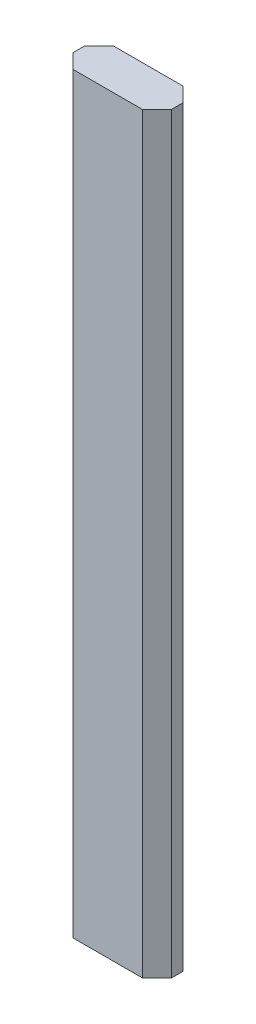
from build123d import *

# Parameters (mm, degrees)
SKETCH1_W           = 17
SKETCH1_H           = 7
BOSS_EXTRUDE1_DEPTH = 130
SKETCH3_W           = 6
SKETCH3_H           = 2
CUT_EXTRUDE1_DEPTH  = 120
CHAMFER1_SIZE       = 2.5


with BuildPart() as part:
    # Sketch1 → Boss-Extrude1 (new body)
    with BuildSketch(Plane(origin=(0, 0, 0), x_dir=(1, 0, 0), z_dir=(0, 1, 0))):
        with Locations((-103.24992295, 53.602982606)):
            Rectangle(SKETCH1_W, SKETCH1_H)
    extrude(amount=BOSS_EXTRUDE1_DEPTH)

    # Sketch3 → Cut-Extrude1 (cut)
    with BuildSketch(Plane.XZ):
        Polygon((-109.24992295, -51.602982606), (-109.24992295, -55.602982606), (-97.24992295, -55.602982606), (-97.24992295, -53.602982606), (-103.24992295, -53.602982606), (-103.24992295, -51.602982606), align=None)
        with Locations((-100.24992295, -52.602982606)):
            Rectangle(SKETCH3_W, SKETCH3_H)
    extrude(amount=-CUT_EXTRUDE1_DEPTH, mode=Mode.SUBTRACT)

    # Chamfer1
    chamfer1_edges = [part.edges().sort_by_distance(p)[0] for p in [
        (-111.74992295, 65, -57.102982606),
        (-94.74992295, 65, -57.102982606),
        (-94.74992295, 65, -50.102982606),
        (-111.74992295, 65, -50.102982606),
    ]]
    chamfer(chamfer1_edges, length=CHAMFER1_SIZE)


solid = part.part
